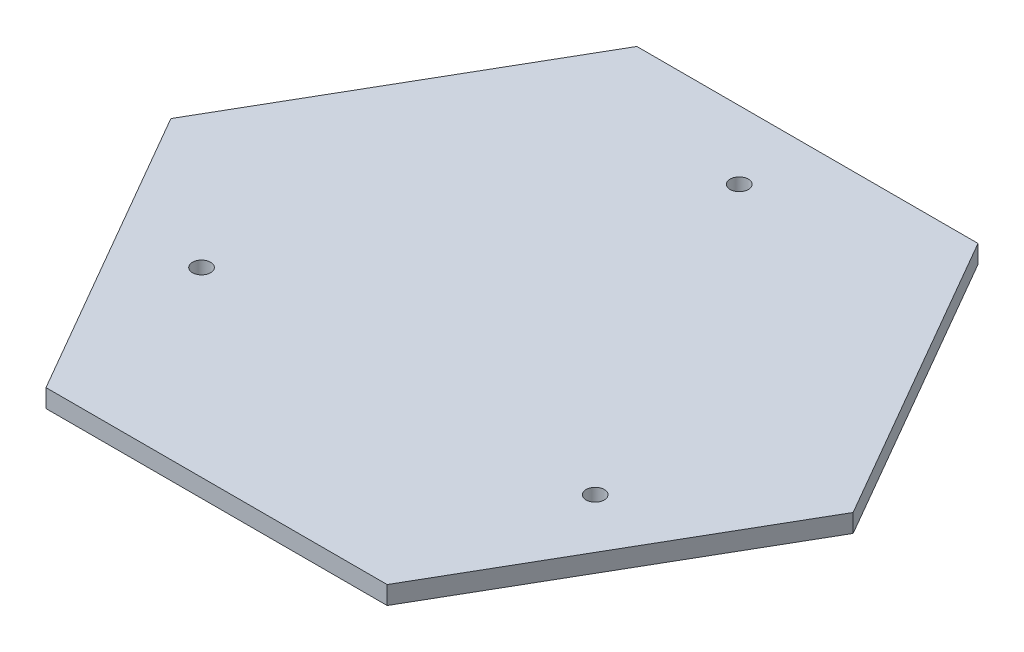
from build123d import *

# Parameters (mm, degrees)
BOSS_EXTRUDE1_DEPTH = 2
SKETCH3_R           = 1
CUT_EXTRUDE1_DEPTH  = 21


with BuildPart() as part:
    # Sketch1 → Boss-Extrude1 (new body)
    with BuildSketch(Plane(origin=(0, 0, 0), x_dir=(1, 0, 0), z_dir=(0, 1, 0))):
        Polygon((37.527767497, 0), (18.763883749, 32.5), (-18.763883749, 32.5), (-37.527767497, 0), (-18.763883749, -32.5), (18.763883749, -32.5), align=None)
    extrude(amount=BOSS_EXTRUDE1_DEPTH)

    # Sketch3 → Cut-Extrude1 (cut)
    with BuildSketch(Plane(origin=(0, 0, 0), x_dir=(1, 0, 0), z_dir=(0, 1, 0))):
        with Locations(Location((0, 25, 0), (0, 0, 270))):
            Circle(SKETCH3_R)
        with Locations(Location((21.650635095, -12.5, 0), (0, 0, 270))):
            Circle(SKETCH3_R)
        with Locations(Location((-21.650635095, -12.5, 0), (0, 0, 270))):
            Circle(SKETCH3_R)
    extrude(amount=CUT_EXTRUDE1_DEPTH, mode=Mode.SUBTRACT)


solid = part.part
